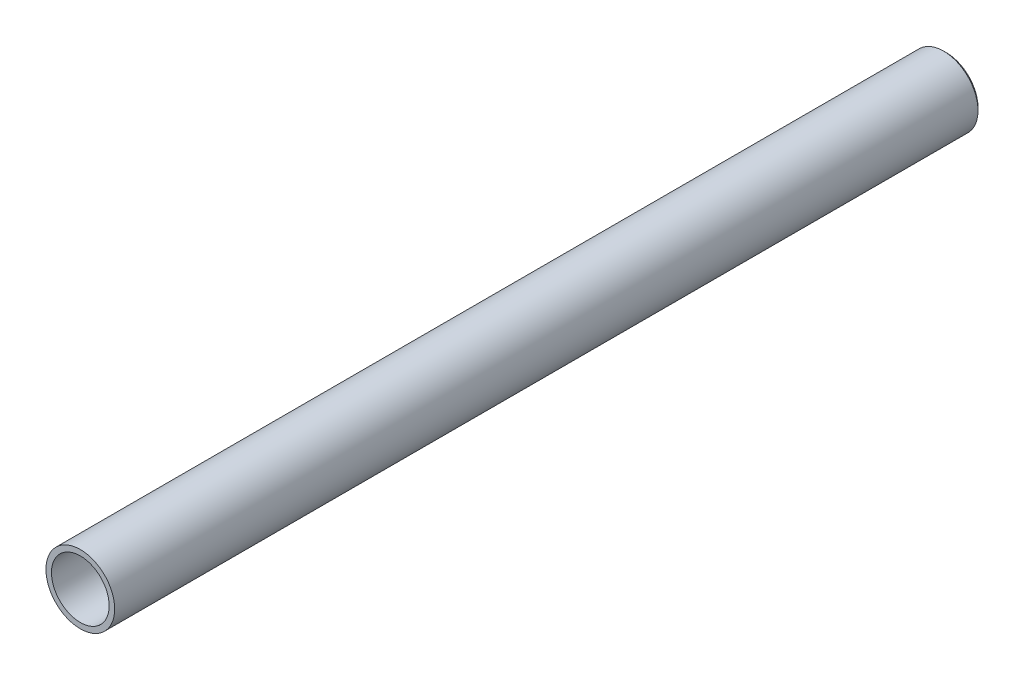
ISO-10303-21;
HEADER;
FILE_DESCRIPTION(('STEP AP214'),'2;1');
FILE_NAME('part.step','',(''),(''),'','','');
FILE_SCHEMA(('AUTOMOTIVE_DESIGN { 1 0 10303 214 1 1 1 1 }'));
ENDSEC;
DATA;
#1=APPLICATION_CONTEXT('core data for automotive mechanical design processes');
#2=APPLICATION_PROTOCOL_DEFINITION('international standard','automotive_design',2000,#1);
#3=PRODUCT_CONTEXT('',#1,'mechanical');
#4=PRODUCT('Part','Part','',(#3));
#5=PRODUCT_RELATED_PRODUCT_CATEGORY('part','',(#4));
#6=PRODUCT_DEFINITION_FORMATION('','',#4);
#7=PRODUCT_DEFINITION_CONTEXT('part definition',#1,'design');
#8=PRODUCT_DEFINITION('design','',#6,#7);
#9=PRODUCT_DEFINITION_SHAPE('','',#8);
#10=(LENGTH_UNIT() NAMED_UNIT(*) SI_UNIT(.MILLI.,.METRE.));
#11=(NAMED_UNIT(*) PLANE_ANGLE_UNIT() SI_UNIT($,.RADIAN.));
#12=(NAMED_UNIT(*) SI_UNIT($,.STERADIAN.) SOLID_ANGLE_UNIT());
#13=UNCERTAINTY_MEASURE_WITH_UNIT(LENGTH_MEASURE(1.E-05),#10,'distance_accuracy_value','');
#14=(GEOMETRIC_REPRESENTATION_CONTEXT(3) GLOBAL_UNCERTAINTY_ASSIGNED_CONTEXT((#13)) GLOBAL_UNIT_ASSIGNED_CONTEXT((#10,
#11,#12)) REPRESENTATION_CONTEXT('',''));
#15=CARTESIAN_POINT('',(0.,0.,0.));
#16=DIRECTION('',(0.,0.,1.));
#17=DIRECTION('',(1.,0.,0.));
#18=AXIS2_PLACEMENT_3D('',#15,#16,#17);
#19=CARTESIAN_POINT('',(0.,0.,315.));
#20=DIRECTION('',(0.,0.,-1.));
#21=DIRECTION('',(-1.,0.,0.));
#22=AXIS2_PLACEMENT_3D('',#19,#20,#21);
#23=CYLINDRICAL_SURFACE('',#22,12.5);
#24=CARTESIAN_POINT('',(0.,0.,1.));
#25=DIRECTION('',(0.,0.,1.));
#26=DIRECTION('',(1.,0.,0.));
#27=AXIS2_PLACEMENT_3D('',#24,#25,#26);
#28=CIRCLE('',#27,12.5);
#29=CARTESIAN_POINT('',(12.5,0.,1.));
#30=VERTEX_POINT('',#29);
#31=EDGE_CURVE('E36',#30,#30,#28,.T.);
#32=ORIENTED_EDGE('',*,*,#31,.T.);
#33=EDGE_LOOP('',(#32));
#34=FACE_BOUND('',#33,.T.);
#35=CARTESIAN_POINT('',(0.,0.,315.));
#36=DIRECTION('',(0.,0.,1.));
#37=DIRECTION('',(1.,0.,0.));
#38=AXIS2_PLACEMENT_3D('',#35,#36,#37);
#39=CIRCLE('',#38,12.5);
#40=CARTESIAN_POINT('',(12.5,0.,315.));
#41=VERTEX_POINT('',#40);
#42=EDGE_CURVE('E40',#41,#41,#39,.T.);
#43=ORIENTED_EDGE('',*,*,#42,.F.);
#44=EDGE_LOOP('',(#43));
#45=FACE_BOUND('',#44,.T.);
#46=ADVANCED_FACE('F26',(#34,#45),#23,.T.);
#47=CARTESIAN_POINT('',(0.,0.,315.));
#48=DIRECTION('',(0.,0.,1.));
#49=DIRECTION('',(1.,0.,0.));
#50=AXIS2_PLACEMENT_3D('',#47,#48,#49);
#51=PLANE('',#50);
#52=CARTESIAN_POINT('',(0.,0.,315.));
#53=DIRECTION('',(0.,0.,1.));
#54=DIRECTION('',(1.,0.,0.));
#55=AXIS2_PLACEMENT_3D('',#52,#53,#54);
#56=CIRCLE('',#55,10.5);
#57=CARTESIAN_POINT('',(10.5,0.,315.));
#58=VERTEX_POINT('',#57);
#59=EDGE_CURVE('E45',#58,#58,#56,.T.);
#60=ORIENTED_EDGE('',*,*,#59,.F.);
#61=EDGE_LOOP('',(#60));
#62=FACE_BOUND('',#61,.T.);
#63=ORIENTED_EDGE('',*,*,#42,.T.);
#64=EDGE_LOOP('',(#63));
#65=FACE_BOUND('',#64,.T.);
#66=ADVANCED_FACE('F51',(#62,#65),#51,.T.);
#67=CARTESIAN_POINT('',(0.,0.,-100.));
#68=DIRECTION('',(0.,0.,1.));
#69=DIRECTION('',(1.,0.,0.));
#70=AXIS2_PLACEMENT_3D('',#67,#68,#69);
#71=CYLINDRICAL_SURFACE('',#70,10.5);
#72=CARTESIAN_POINT('',(0.,0.,1.));
#73=DIRECTION('',(0.,0.,1.));
#74=DIRECTION('',(1.,0.,0.));
#75=AXIS2_PLACEMENT_3D('',#72,#73,#74);
#76=CIRCLE('',#75,10.5);
#77=CARTESIAN_POINT('',(10.5,0.,1.));
#78=VERTEX_POINT('',#77);
#79=EDGE_CURVE('E10',#78,#78,#76,.F.);
#80=ORIENTED_EDGE('',*,*,#79,.T.);
#81=EDGE_LOOP('',(#80));
#82=FACE_BOUND('',#81,.T.);
#83=ORIENTED_EDGE('',*,*,#59,.T.);
#84=EDGE_LOOP('',(#83));
#85=FACE_BOUND('',#84,.T.);
#86=ADVANCED_FACE('F49',(#82,#85),#71,.F.);
#87=CARTESIAN_POINT('',(0.,0.,1.));
#88=DIRECTION('',(0.,0.,1.));
#89=DIRECTION('',(1.,0.,0.));
#90=AXIS2_PLACEMENT_3D('',#87,#88,#89);
#91=CONICAL_SURFACE('',#90,12.5,0.785398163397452);
#92=CARTESIAN_POINT('',(0.,0.,0.));
#93=DIRECTION('',(0.,0.,1.));
#94=DIRECTION('',(1.,0.,0.));
#95=AXIS2_PLACEMENT_3D('',#92,#93,#94);
#96=CIRCLE('',#95,11.5);
#97=CARTESIAN_POINT('',(11.5,0.,0.));
#98=VERTEX_POINT('',#97);
#99=EDGE_CURVE('E32',#98,#98,#96,.F.);
#100=ORIENTED_EDGE('',*,*,#99,.F.);
#101=EDGE_LOOP('',(#100));
#102=FACE_BOUND('',#101,.T.);
#103=ORIENTED_EDGE('',*,*,#31,.F.);
#104=EDGE_LOOP('',(#103));
#105=FACE_BOUND('',#104,.T.);
#106=ADVANCED_FACE('F61',(#102,#105),#91,.T.);
#107=CARTESIAN_POINT('',(0.,0.,0.));
#108=DIRECTION('',(0.,0.,-1.));
#109=DIRECTION('',(-1.,0.,0.));
#110=AXIS2_PLACEMENT_3D('',#107,#108,#109);
#111=CONICAL_SURFACE('',#110,11.5,0.785398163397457);
#112=ORIENTED_EDGE('',*,*,#79,.F.);
#113=EDGE_LOOP('',(#112));
#114=FACE_BOUND('',#113,.T.);
#115=ORIENTED_EDGE('',*,*,#99,.T.);
#116=EDGE_LOOP('',(#115));
#117=FACE_BOUND('',#116,.T.);
#118=ADVANCED_FACE('F66',(#114,#117),#111,.F.);
#119=CLOSED_SHELL('',(#46,#66,#86,#106,#118));
#120=MANIFOLD_SOLID_BREP('B2',#119);
#121=ADVANCED_BREP_SHAPE_REPRESENTATION('',(#18,#120),#14);
#122=SHAPE_DEFINITION_REPRESENTATION(#9,#121);
ENDSEC;
END-ISO-10303-21;
